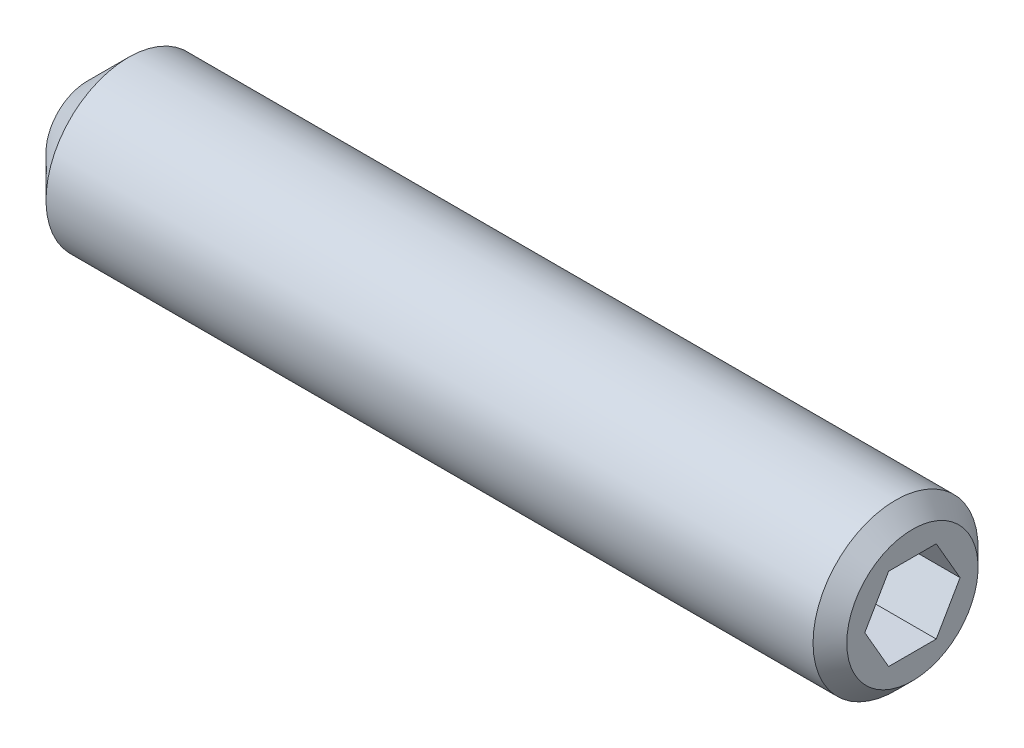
ISO-10303-21;
HEADER;
FILE_DESCRIPTION(('STEP AP214'),'2;1');
FILE_NAME('part.step','',(''),(''),'','','');
FILE_SCHEMA(('AUTOMOTIVE_DESIGN { 1 0 10303 214 1 1 1 1 }'));
ENDSEC;
DATA;
#1=APPLICATION_CONTEXT('core data for automotive mechanical design processes');
#2=APPLICATION_PROTOCOL_DEFINITION('international standard','automotive_design',2000,#1);
#3=PRODUCT_CONTEXT('',#1,'mechanical');
#4=PRODUCT('Part','Part','',(#3));
#5=PRODUCT_RELATED_PRODUCT_CATEGORY('part','',(#4));
#6=PRODUCT_DEFINITION_FORMATION('','',#4);
#7=PRODUCT_DEFINITION_CONTEXT('part definition',#1,'design');
#8=PRODUCT_DEFINITION('design','',#6,#7);
#9=PRODUCT_DEFINITION_SHAPE('','',#8);
#10=(LENGTH_UNIT() NAMED_UNIT(*) SI_UNIT(.MILLI.,.METRE.));
#11=(NAMED_UNIT(*) PLANE_ANGLE_UNIT() SI_UNIT($,.RADIAN.));
#12=(NAMED_UNIT(*) SI_UNIT($,.STERADIAN.) SOLID_ANGLE_UNIT());
#13=UNCERTAINTY_MEASURE_WITH_UNIT(LENGTH_MEASURE(1.E-05),#10,'distance_accuracy_value','');
#14=(GEOMETRIC_REPRESENTATION_CONTEXT(3) GLOBAL_UNCERTAINTY_ASSIGNED_CONTEXT((#13)) GLOBAL_UNIT_ASSIGNED_CONTEXT((#10,
#11,#12)) REPRESENTATION_CONTEXT('',''));
#15=CARTESIAN_POINT('',(0.,0.,0.));
#16=DIRECTION('',(0.,0.,1.));
#17=DIRECTION('',(1.,0.,0.));
#18=AXIS2_PLACEMENT_3D('',#15,#16,#17);
#19=CARTESIAN_POINT('',(26.5,-0.785452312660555,-1.36044331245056));
#20=DIRECTION('',(1.,0.,0.));
#21=DIRECTION('',(0.,0.,-1.));
#22=AXIS2_PLACEMENT_3D('',#19,#20,#21);
#23=PLANE('',#22);
#24=CARTESIAN_POINT('',(26.5000000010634,0.,0.));
#25=DIRECTION('',(1.,0.,0.));
#26=DIRECTION('',(0.,0.,-1.));
#27=AXIS2_PLACEMENT_3D('',#24,#25,#26);
#28=CIRCLE('',#27,1.7320508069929);
#29=CARTESIAN_POINT('',(26.5000000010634,1.49999999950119,-0.866025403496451));
#30=VERTEX_POINT('',#29);
#31=CARTESIAN_POINT('',(26.5000000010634,0.,-1.7320508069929));
#32=VERTEX_POINT('',#31);
#33=EDGE_CURVE('E19',#30,#32,#28,.F.);
#34=ORIENTED_EDGE('',*,*,#33,.T.);
#35=DIRECTION('',(0.,-0.866025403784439,-0.5));
#36=VECTOR('',#35,1.);
#37=CARTESIAN_POINT('',(26.5,1.5,-0.866025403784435));
#38=LINE('',#37,#36);
#39=EDGE_CURVE('E91',#30,#32,#38,.T.);
#40=ORIENTED_EDGE('',*,*,#39,.F.);
#41=EDGE_LOOP('',(#34,#40));
#42=FACE_BOUND('',#41,.T.);
#43=ADVANCED_FACE('F16',(#42),#23,.F.);
#44=CARTESIAN_POINT('',(26.5,-0.785452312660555,-1.36044331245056));
#45=DIRECTION('',(1.,0.,0.));
#46=DIRECTION('',(0.,0.,-1.));
#47=AXIS2_PLACEMENT_3D('',#44,#45,#46);
#48=PLANE('',#47);
#49=CARTESIAN_POINT('',(26.5000000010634,0.,0.));
#50=DIRECTION('',(1.,0.,0.));
#51=DIRECTION('',(0.,0.,-1.));
#52=AXIS2_PLACEMENT_3D('',#49,#50,#51);
#53=CIRCLE('',#52,1.7320508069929);
#54=CARTESIAN_POINT('',(26.5000000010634,-1.49999999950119,-0.86602540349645));
#55=VERTEX_POINT('',#54);
#56=CARTESIAN_POINT('',(26.5000000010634,-1.49999999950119,0.866025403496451));
#57=VERTEX_POINT('',#56);
#58=EDGE_CURVE('E113',#55,#57,#53,.F.);
#59=ORIENTED_EDGE('',*,*,#58,.T.);
#60=DIRECTION('',(0.,0.,-1.));
#61=VECTOR('',#60,1.);
#62=CARTESIAN_POINT('',(26.5,-1.5,-1.36044331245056));
#63=LINE('',#62,#61);
#64=EDGE_CURVE('E100',#55,#57,#63,.F.);
#65=ORIENTED_EDGE('',*,*,#64,.F.);
#66=EDGE_LOOP('',(#59,#65));
#67=FACE_BOUND('',#66,.T.);
#68=ADVANCED_FACE('F293',(#67),#48,.F.);
#69=CARTESIAN_POINT('',(26.5,-0.785452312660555,-1.36044331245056));
#70=DIRECTION('',(1.,0.,0.));
#71=DIRECTION('',(0.,0.,-1.));
#72=AXIS2_PLACEMENT_3D('',#69,#70,#71);
#73=PLANE('',#72);
#74=CARTESIAN_POINT('',(26.5000000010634,0.,0.));
#75=DIRECTION('',(1.,0.,0.));
#76=DIRECTION('',(0.,0.,-1.));
#77=AXIS2_PLACEMENT_3D('',#74,#75,#76);
#78=CIRCLE('',#77,1.7320508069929);
#79=CARTESIAN_POINT('',(26.5000000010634,0.,1.7320508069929));
#80=VERTEX_POINT('',#79);
#81=EDGE_CURVE('E115',#57,#80,#78,.F.);
#82=ORIENTED_EDGE('',*,*,#81,.T.);
#83=DIRECTION('',(0.,0.866025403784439,0.5));
#84=VECTOR('',#83,1.);
#85=CARTESIAN_POINT('',(26.5,-1.5,0.866025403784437));
#86=LINE('',#85,#84);
#87=EDGE_CURVE('E136',#57,#80,#86,.T.);
#88=ORIENTED_EDGE('',*,*,#87,.F.);
#89=EDGE_LOOP('',(#82,#88));
#90=FACE_BOUND('',#89,.T.);
#91=ADVANCED_FACE('F285',(#90),#73,.F.);
#92=CARTESIAN_POINT('',(26.5,-0.785452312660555,-1.36044331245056));
#93=DIRECTION('',(1.,0.,0.));
#94=DIRECTION('',(0.,0.,-1.));
#95=AXIS2_PLACEMENT_3D('',#92,#93,#94);
#96=PLANE('',#95);
#97=CARTESIAN_POINT('',(26.5000000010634,0.,0.));
#98=DIRECTION('',(1.,0.,0.));
#99=DIRECTION('',(0.,0.,-1.));
#100=AXIS2_PLACEMENT_3D('',#97,#98,#99);
#101=CIRCLE('',#100,1.7320508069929);
#102=CARTESIAN_POINT('',(26.5000000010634,1.49999999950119,0.866025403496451));
#103=VERTEX_POINT('',#102);
#104=EDGE_CURVE('E107',#80,#103,#101,.F.);
#105=ORIENTED_EDGE('',*,*,#104,.T.);
#106=DIRECTION('',(0.,0.866025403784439,-0.5));
#107=VECTOR('',#106,1.);
#108=CARTESIAN_POINT('',(26.5,0.,1.73205080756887));
#109=LINE('',#108,#107);
#110=EDGE_CURVE('E83',#80,#103,#109,.T.);
#111=ORIENTED_EDGE('',*,*,#110,.F.);
#112=EDGE_LOOP('',(#105,#111));
#113=FACE_BOUND('',#112,.T.);
#114=ADVANCED_FACE('F278',(#113),#96,.F.);
#115=CARTESIAN_POINT('',(26.5,-0.785452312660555,-1.36044331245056));
#116=DIRECTION('',(1.,0.,0.));
#117=DIRECTION('',(0.,0.,-1.));
#118=AXIS2_PLACEMENT_3D('',#115,#116,#117);
#119=PLANE('',#118);
#120=CARTESIAN_POINT('',(26.5000000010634,0.,0.));
#121=DIRECTION('',(1.,0.,0.));
#122=DIRECTION('',(0.,0.,-1.));
#123=AXIS2_PLACEMENT_3D('',#120,#121,#122);
#124=CIRCLE('',#123,1.7320508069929);
#125=EDGE_CURVE('E102',#103,#30,#124,.F.);
#126=ORIENTED_EDGE('',*,*,#125,.T.);
#127=DIRECTION('',(0.,0.,-1.));
#128=VECTOR('',#127,1.);
#129=CARTESIAN_POINT('',(26.5,1.5,-1.36044331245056));
#130=LINE('',#129,#128);
#131=EDGE_CURVE('E73',#103,#30,#130,.T.);
#132=ORIENTED_EDGE('',*,*,#131,.F.);
#133=EDGE_LOOP('',(#126,#132));
#134=FACE_BOUND('',#133,.T.);
#135=ADVANCED_FACE('F103',(#134),#119,.F.);
#136=CARTESIAN_POINT('',(26.500000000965,0.,0.));
#137=DIRECTION('',(1.,0.,0.));
#138=DIRECTION('',(0.,0.,-1.));
#139=AXIS2_PLACEMENT_3D('',#136,#137,#138);
#140=CONICAL_SURFACE('',#139,1.73205080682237,1.04719754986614);
#141=CARTESIAN_POINT('',(25.4999999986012,-1.13686837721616E-10,0.));
#142=VERTEX_POINT('',#141);
#143=VERTEX_LOOP('',#142);
#144=FACE_BOUND('',#143,.T.);
#145=ORIENTED_EDGE('',*,*,#104,.F.);
#146=ORIENTED_EDGE('',*,*,#81,.F.);
#147=ORIENTED_EDGE('',*,*,#58,.F.);
#148=CARTESIAN_POINT('',(26.5000000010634,0.,0.));
#149=DIRECTION('',(1.,0.,0.));
#150=DIRECTION('',(0.,0.,-1.));
#151=AXIS2_PLACEMENT_3D('',#148,#149,#150);
#152=CIRCLE('',#151,1.7320508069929);
#153=EDGE_CURVE('E106',#55,#32,#152,.T.);
#154=ORIENTED_EDGE('',*,*,#153,.T.);
#155=ORIENTED_EDGE('',*,*,#33,.F.);
#156=ORIENTED_EDGE('',*,*,#125,.F.);
#157=EDGE_LOOP('',(#145,#146,#147,#154,#155,#156));
#158=FACE_BOUND('',#157,.T.);
#159=ADVANCED_FACE('F109',(#144,#158),#140,.F.);
#160=CARTESIAN_POINT('',(26.5,-0.785452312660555,-1.36044331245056));
#161=DIRECTION('',(1.,0.,0.));
#162=DIRECTION('',(0.,0.,-1.));
#163=AXIS2_PLACEMENT_3D('',#160,#161,#162);
#164=PLANE('',#163);
#165=ORIENTED_EDGE('',*,*,#153,.F.);
#166=DIRECTION('',(0.,0.866025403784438,-0.5));
#167=VECTOR('',#166,1.);
#168=CARTESIAN_POINT('',(26.5,-1.5,-0.866025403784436));
#169=LINE('',#168,#167);
#170=EDGE_CURVE('E145',#55,#32,#169,.T.);
#171=ORIENTED_EDGE('',*,*,#170,.T.);
#172=EDGE_LOOP('',(#165,#171));
#173=FACE_BOUND('',#172,.T.);
#174=ADVANCED_FACE('F256',(#173),#164,.F.);
#175=CARTESIAN_POINT('',(30.,-1.5,-0.866025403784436));
#176=DIRECTION('',(0.,-0.5,-0.866025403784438));
#177=DIRECTION('',(0.,0.866025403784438,-0.5));
#178=AXIS2_PLACEMENT_3D('',#175,#176,#177);
#179=PLANE('',#178);
#180=DIRECTION('',(1.,0.,0.));
#181=VECTOR('',#180,1.);
#182=CARTESIAN_POINT('',(30.,-1.5,-0.866025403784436));
#183=LINE('',#182,#181);
#184=CARTESIAN_POINT('',(30.,-1.5,-0.866025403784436));
#185=VERTEX_POINT('',#184);
#186=EDGE_CURVE('E141',#55,#185,#183,.T.);
#187=ORIENTED_EDGE('',*,*,#186,.T.);
#188=DIRECTION('',(0.,0.866025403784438,-0.5));
#189=VECTOR('',#188,1.);
#190=CARTESIAN_POINT('',(30.,-1.5,-0.866025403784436));
#191=LINE('',#190,#189);
#192=CARTESIAN_POINT('',(30.,0.,-1.73205080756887));
#193=VERTEX_POINT('',#192);
#194=EDGE_CURVE('E123',#193,#185,#191,.F.);
#195=ORIENTED_EDGE('',*,*,#194,.F.);
#196=DIRECTION('',(1.,0.,0.));
#197=VECTOR('',#196,1.);
#198=CARTESIAN_POINT('',(30.,0.,-1.73205080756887));
#199=LINE('',#198,#197);
#200=EDGE_CURVE('E131',#193,#32,#199,.F.);
#201=ORIENTED_EDGE('',*,*,#200,.T.);
#202=ORIENTED_EDGE('',*,*,#170,.F.);
#203=EDGE_LOOP('',(#187,#195,#201,#202));
#204=FACE_BOUND('',#203,.T.);
#205=ADVANCED_FACE('F248',(#204),#179,.F.);
#206=CARTESIAN_POINT('',(30.,-1.5,0.866025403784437));
#207=DIRECTION('',(0.,-1.,0.));
#208=DIRECTION('',(0.,0.,-1.));
#209=AXIS2_PLACEMENT_3D('',#206,#207,#208);
#210=PLANE('',#209);
#211=DIRECTION('',(1.,0.,0.));
#212=VECTOR('',#211,1.);
#213=CARTESIAN_POINT('',(30.,-1.5,0.866025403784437));
#214=LINE('',#213,#212);
#215=CARTESIAN_POINT('',(30.,-1.5,0.866025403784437));
#216=VERTEX_POINT('',#215);
#217=EDGE_CURVE('E128',#57,#216,#214,.T.);
#218=ORIENTED_EDGE('',*,*,#217,.T.);
#219=DIRECTION('',(0.,0.,-1.));
#220=VECTOR('',#219,1.);
#221=CARTESIAN_POINT('',(30.,-1.5,0.866025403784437));
#222=LINE('',#221,#220);
#223=EDGE_CURVE('E144',#185,#216,#222,.F.);
#224=ORIENTED_EDGE('',*,*,#223,.F.);
#225=ORIENTED_EDGE('',*,*,#186,.F.);
#226=ORIENTED_EDGE('',*,*,#64,.T.);
#227=EDGE_LOOP('',(#218,#224,#225,#226));
#228=FACE_BOUND('',#227,.T.);
#229=ADVANCED_FACE('F241',(#228),#210,.F.);
#230=CARTESIAN_POINT('',(30.,0.,-1.73205080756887));
#231=DIRECTION('',(0.,0.5,-0.866025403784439));
#232=DIRECTION('',(0.,0.866025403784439,0.5));
#233=AXIS2_PLACEMENT_3D('',#230,#231,#232);
#234=PLANE('',#233);
#235=ORIENTED_EDGE('',*,*,#200,.F.);
#236=DIRECTION('',(0.,0.866025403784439,0.5));
#237=VECTOR('',#236,1.);
#238=CARTESIAN_POINT('',(30.,0.,-1.73205080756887));
#239=LINE('',#238,#237);
#240=CARTESIAN_POINT('',(30.,1.5,-0.866025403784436));
#241=VERTEX_POINT('',#240);
#242=EDGE_CURVE('E93',#241,#193,#239,.F.);
#243=ORIENTED_EDGE('',*,*,#242,.F.);
#244=DIRECTION('',(1.,0.,0.));
#245=VECTOR('',#244,1.);
#246=CARTESIAN_POINT('',(30.,1.5,-0.866025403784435));
#247=LINE('',#246,#245);
#248=EDGE_CURVE('E76',#241,#30,#247,.F.);
#249=ORIENTED_EDGE('',*,*,#248,.T.);
#250=ORIENTED_EDGE('',*,*,#39,.T.);
#251=EDGE_LOOP('',(#235,#243,#249,#250));
#252=FACE_BOUND('',#251,.T.);
#253=ADVANCED_FACE('F90',(#252),#234,.F.);
#254=CARTESIAN_POINT('',(30.,0.,1.73205080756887));
#255=DIRECTION('',(0.,-0.5,0.866025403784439));
#256=DIRECTION('',(0.,-0.866025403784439,-0.5));
#257=AXIS2_PLACEMENT_3D('',#254,#255,#256);
#258=PLANE('',#257);
#259=DIRECTION('',(1.,0.,0.));
#260=VECTOR('',#259,1.);
#261=CARTESIAN_POINT('',(30.,0.,1.73205080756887));
#262=LINE('',#261,#260);
#263=CARTESIAN_POINT('',(30.,0.,1.73205080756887));
#264=VERTEX_POINT('',#263);
#265=EDGE_CURVE('E94',#80,#264,#262,.T.);
#266=ORIENTED_EDGE('',*,*,#265,.T.);
#267=DIRECTION('',(0.,-0.866025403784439,-0.5));
#268=VECTOR('',#267,1.);
#269=CARTESIAN_POINT('',(30.,0.,1.73205080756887));
#270=LINE('',#269,#268);
#271=EDGE_CURVE('E34',#216,#264,#270,.F.);
#272=ORIENTED_EDGE('',*,*,#271,.F.);
#273=ORIENTED_EDGE('',*,*,#217,.F.);
#274=ORIENTED_EDGE('',*,*,#87,.T.);
#275=EDGE_LOOP('',(#266,#272,#273,#274));
#276=FACE_BOUND('',#275,.T.);
#277=ADVANCED_FACE('F227',(#276),#258,.F.);
#278=CARTESIAN_POINT('',(30.,1.5,-0.866025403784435));
#279=DIRECTION('',(0.,1.,0.));
#280=DIRECTION('',(0.,0.,1.));
#281=AXIS2_PLACEMENT_3D('',#278,#279,#280);
#282=PLANE('',#281);
#283=ORIENTED_EDGE('',*,*,#248,.F.);
#284=DIRECTION('',(0.,0.,1.));
#285=VECTOR('',#284,1.);
#286=CARTESIAN_POINT('',(30.,1.5,-0.866025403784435));
#287=LINE('',#286,#285);
#288=CARTESIAN_POINT('',(30.,1.5,0.866025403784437));
#289=VERTEX_POINT('',#288);
#290=EDGE_CURVE('E95',#289,#241,#287,.F.);
#291=ORIENTED_EDGE('',*,*,#290,.F.);
#292=DIRECTION('',(1.,0.,0.));
#293=VECTOR('',#292,1.);
#294=CARTESIAN_POINT('',(30.,1.5,0.866025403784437));
#295=LINE('',#294,#293);
#296=EDGE_CURVE('E78',#289,#103,#295,.F.);
#297=ORIENTED_EDGE('',*,*,#296,.T.);
#298=ORIENTED_EDGE('',*,*,#131,.T.);
#299=EDGE_LOOP('',(#283,#291,#297,#298));
#300=FACE_BOUND('',#299,.T.);
#301=ADVANCED_FACE('F75',(#300),#282,.F.);
#302=CARTESIAN_POINT('',(30.,1.5,0.866025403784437));
#303=DIRECTION('',(0.,0.5,0.866025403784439));
#304=DIRECTION('',(0.,-0.866025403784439,0.5));
#305=AXIS2_PLACEMENT_3D('',#302,#303,#304);
#306=PLANE('',#305);
#307=ORIENTED_EDGE('',*,*,#296,.F.);
#308=DIRECTION('',(0.,0.866025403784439,-0.5));
#309=VECTOR('',#308,1.);
#310=CARTESIAN_POINT('',(30.,0.,1.73205080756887));
#311=LINE('',#310,#309);
#312=EDGE_CURVE('E133',#264,#289,#311,.T.);
#313=ORIENTED_EDGE('',*,*,#312,.F.);
#314=ORIENTED_EDGE('',*,*,#265,.F.);
#315=ORIENTED_EDGE('',*,*,#110,.T.);
#316=EDGE_LOOP('',(#307,#313,#314,#315));
#317=FACE_BOUND('',#316,.T.);
#318=ADVANCED_FACE('F176',(#317),#306,.F.);
#319=CARTESIAN_POINT('',(-8.5265126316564E-10,0.,0.));
#320=DIRECTION('',(-1.,0.,0.));
#321=DIRECTION('',(0.,-1.,0.));
#322=AXIS2_PLACEMENT_3D('',#319,#320,#321);
#323=CONICAL_SURFACE('',#322,1.49999999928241,1.04719754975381);
#324=CARTESIAN_POINT('',(0.866025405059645,-2.27373675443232E-10,0.));
#325=VERTEX_POINT('',#324);
#326=VERTEX_LOOP('',#325);
#327=FACE_BOUND('',#326,.T.);
#328=CARTESIAN_POINT('',(-6.82121026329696E-10,0.,0.));
#329=DIRECTION('',(1.,0.,0.));
#330=DIRECTION('',(0.,-1.,0.));
#331=AXIS2_PLACEMENT_3D('',#328,#329,#330);
#332=CIRCLE('',#331,1.50000000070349);
#333=CARTESIAN_POINT('',(-6.82121026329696E-10,-1.50000000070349,0.));
#334=VERTEX_POINT('',#333);
#335=EDGE_CURVE('E127',#334,#334,#332,.T.);
#336=ORIENTED_EDGE('',*,*,#335,.F.);
#337=EDGE_LOOP('',(#336));
#338=FACE_BOUND('',#337,.T.);
#339=ADVANCED_FACE('F174',(#327,#338),#323,.F.);
#340=CARTESIAN_POINT('',(30.,2.36602540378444,0.));
#341=DIRECTION('',(1.,0.,0.));
#342=DIRECTION('',(0.,0.,-1.));
#343=AXIS2_PLACEMENT_3D('',#340,#341,#342);
#344=PLANE('',#343);
#345=ORIENTED_EDGE('',*,*,#271,.T.);
#346=ORIENTED_EDGE('',*,*,#312,.T.);
#347=ORIENTED_EDGE('',*,*,#290,.T.);
#348=ORIENTED_EDGE('',*,*,#242,.T.);
#349=ORIENTED_EDGE('',*,*,#194,.T.);
#350=ORIENTED_EDGE('',*,*,#223,.T.);
#351=EDGE_LOOP('',(#345,#346,#347,#348,#349,#350));
#352=FACE_BOUND('',#351,.T.);
#353=CARTESIAN_POINT('',(30.0000000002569,0.,0.));
#354=DIRECTION('',(-1.,0.,0.));
#355=DIRECTION('',(0.,0.,1.));
#356=AXIS2_PLACEMENT_3D('',#353,#354,#355);
#357=CIRCLE('',#356,2.38655000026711);
#358=CARTESIAN_POINT('',(30.0000000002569,0.,2.38655000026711));
#359=VERTEX_POINT('',#358);
#360=EDGE_CURVE('E124',#359,#359,#357,.T.);
#361=ORIENTED_EDGE('',*,*,#360,.F.);
#362=EDGE_LOOP('',(#361));
#363=FACE_BOUND('',#362,.T.);
#364=ADVANCED_FACE('F170',(#352,#363),#344,.T.);
#365=CARTESIAN_POINT('',(1.50000000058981,0.,0.));
#366=DIRECTION('',(1.,0.,0.));
#367=DIRECTION('',(0.,0.,-1.));
#368=AXIS2_PLACEMENT_3D('',#365,#366,#367);
#369=CONICAL_SURFACE('',#368,2.99999999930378,0.785398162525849);
#370=CARTESIAN_POINT('',(1.5,0.,0.));
#371=DIRECTION('',(1.,0.,0.));
#372=DIRECTION('',(0.,1.,0.));
#373=AXIS2_PLACEMENT_3D('',#370,#371,#372);
#374=CIRCLE('',#373,3.);
#375=CARTESIAN_POINT('',(1.5,3.,0.));
#376=VERTEX_POINT('',#375);
#377=EDGE_CURVE('E25',#376,#376,#374,.T.);
#378=ORIENTED_EDGE('',*,*,#377,.F.);
#379=EDGE_LOOP('',(#378));
#380=FACE_BOUND('',#379,.T.);
#381=ORIENTED_EDGE('',*,*,#335,.T.);
#382=EDGE_LOOP('',(#381));
#383=FACE_BOUND('',#382,.T.);
#384=ADVANCED_FACE('F166',(#380,#383),#369,.T.);
#385=CARTESIAN_POINT('',(29.3865499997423,0.,0.));
#386=DIRECTION('',(-1.,0.,0.));
#387=DIRECTION('',(0.,0.,1.));
#388=AXIS2_PLACEMENT_3D('',#385,#386,#387);
#389=CONICAL_SURFACE('',#388,2.99999999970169,0.785398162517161);
#390=ORIENTED_EDGE('',*,*,#360,.T.);
#391=EDGE_LOOP('',(#390));
#392=FACE_BOUND('',#391,.T.);
#393=CARTESIAN_POINT('',(29.38655,0.,0.));
#394=DIRECTION('',(1.,0.,0.));
#395=DIRECTION('',(0.,1.,0.));
#396=AXIS2_PLACEMENT_3D('',#393,#394,#395);
#397=CIRCLE('',#396,3.);
#398=CARTESIAN_POINT('',(29.38655,3.,0.));
#399=VERTEX_POINT('',#398);
#400=EDGE_CURVE('E11',#399,#399,#397,.F.);
#401=ORIENTED_EDGE('',*,*,#400,.F.);
#402=EDGE_LOOP('',(#401));
#403=FACE_BOUND('',#402,.T.);
#404=ADVANCED_FACE('F169',(#392,#403),#389,.T.);
#405=CARTESIAN_POINT('',(15.,0.,0.));
#406=DIRECTION('',(1.,0.,0.));
#407=DIRECTION('',(0.,1.,0.));
#408=AXIS2_PLACEMENT_3D('',#405,#406,#407);
#409=CYLINDRICAL_SURFACE('',#408,3.);
#410=ORIENTED_EDGE('',*,*,#400,.T.);
#411=EDGE_LOOP('',(#410));
#412=FACE_BOUND('',#411,.T.);
#413=ORIENTED_EDGE('',*,*,#377,.T.);
#414=EDGE_LOOP('',(#413));
#415=FACE_BOUND('',#414,.T.);
#416=ADVANCED_FACE('F164',(#412,#415),#409,.T.);
#417=CLOSED_SHELL('',(#43,#68,#91,#114,#135,#159,#174,#205,#229,#253,#277,#301,#318,#339,#364,
#384,#404,#416));
#418=MANIFOLD_SOLID_BREP('B1',#417);
#419=ADVANCED_BREP_SHAPE_REPRESENTATION('',(#18,#418),#14);
#420=SHAPE_DEFINITION_REPRESENTATION(#9,#419);
ENDSEC;
END-ISO-10303-21;
